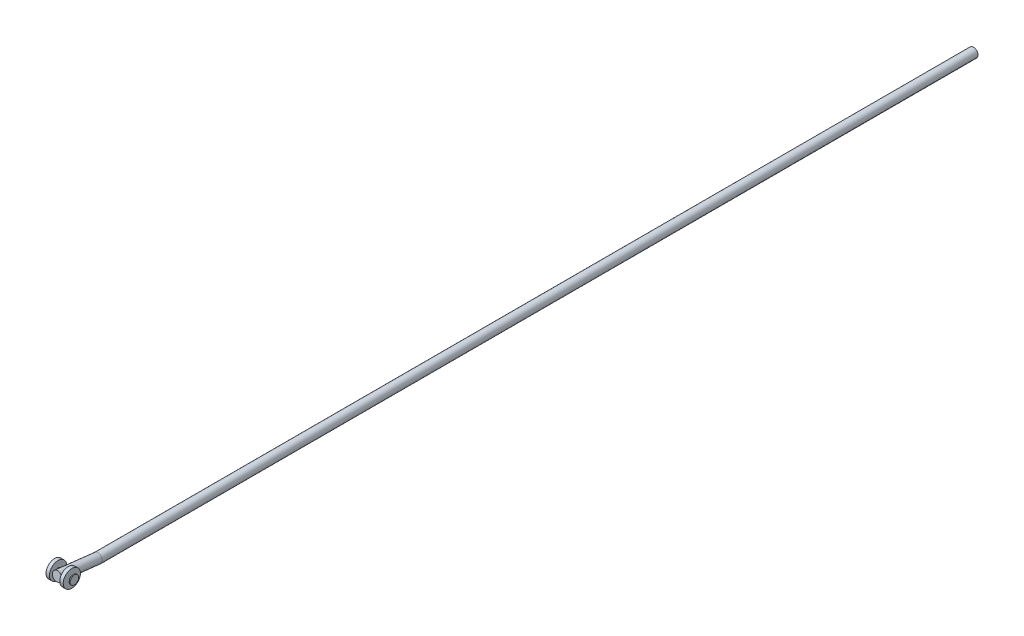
ISO-10303-21;
HEADER;
FILE_DESCRIPTION(('STEP AP214'),'2;1');
FILE_NAME('part.step','',(''),(''),'','','');
FILE_SCHEMA(('AUTOMOTIVE_DESIGN { 1 0 10303 214 1 1 1 1 }'));
ENDSEC;
DATA;
#1=APPLICATION_CONTEXT('core data for automotive mechanical design processes');
#2=APPLICATION_PROTOCOL_DEFINITION('international standard','automotive_design',2000,#1);
#3=PRODUCT_CONTEXT('',#1,'mechanical');
#4=PRODUCT('Part','Part','',(#3));
#5=PRODUCT_RELATED_PRODUCT_CATEGORY('part','',(#4));
#6=PRODUCT_DEFINITION_FORMATION('','',#4);
#7=PRODUCT_DEFINITION_CONTEXT('part definition',#1,'design');
#8=PRODUCT_DEFINITION('design','',#6,#7);
#9=PRODUCT_DEFINITION_SHAPE('','',#8);
#10=(LENGTH_UNIT() NAMED_UNIT(*) SI_UNIT(.MILLI.,.METRE.));
#11=(NAMED_UNIT(*) PLANE_ANGLE_UNIT() SI_UNIT($,.RADIAN.));
#12=(NAMED_UNIT(*) SI_UNIT($,.STERADIAN.) SOLID_ANGLE_UNIT());
#13=UNCERTAINTY_MEASURE_WITH_UNIT(LENGTH_MEASURE(1.E-05),#10,'distance_accuracy_value','');
#14=(GEOMETRIC_REPRESENTATION_CONTEXT(3) GLOBAL_UNCERTAINTY_ASSIGNED_CONTEXT((#13)) GLOBAL_UNIT_ASSIGNED_CONTEXT((#10,
#11,#12)) REPRESENTATION_CONTEXT('',''));
#15=CARTESIAN_POINT('',(0.,0.,0.));
#16=DIRECTION('',(0.,0.,1.));
#17=DIRECTION('',(1.,0.,0.));
#18=AXIS2_PLACEMENT_3D('',#15,#16,#17);
#19=CARTESIAN_POINT('',(9.75,3.41806824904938,792.5));
#20=DIRECTION('',(-1.,0.,0.));
#21=DIRECTION('',(0.,0.,1.));
#22=AXIS2_PLACEMENT_3D('',#19,#20,#21);
#23=CYLINDRICAL_SURFACE('',#22,2.);
#24=CARTESIAN_POINT('',(7.5,3.41806824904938,792.5));
#25=DIRECTION('',(-1.,0.,0.));
#26=DIRECTION('',(0.,0.,1.));
#27=AXIS2_PLACEMENT_3D('',#24,#25,#26);
#28=CIRCLE('',#27,2.);
#29=CARTESIAN_POINT('',(7.5,3.41806824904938,794.5));
#30=VERTEX_POINT('',#29);
#31=EDGE_CURVE('E20',#30,#30,#28,.T.);
#32=ORIENTED_EDGE('',*,*,#31,.F.);
#33=EDGE_LOOP('',(#32));
#34=FACE_BOUND('',#33,.T.);
#35=CARTESIAN_POINT('',(8.95,3.41806824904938,792.5));
#36=DIRECTION('',(1.,0.,0.));
#37=DIRECTION('',(0.,0.,-1.));
#38=AXIS2_PLACEMENT_3D('',#35,#36,#37);
#39=CIRCLE('',#38,2.);
#40=CARTESIAN_POINT('',(8.95,3.41806824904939,790.5));
#41=VERTEX_POINT('',#40);
#42=EDGE_CURVE('E8',#41,#41,#39,.T.);
#43=ORIENTED_EDGE('',*,*,#42,.F.);
#44=EDGE_LOOP('',(#43));
#45=FACE_BOUND('',#44,.T.);
#46=ADVANCED_FACE('F12',(#34,#45),#23,.T.);
#47=CARTESIAN_POINT('',(0.,0.,762.5));
#48=DIRECTION('',(0.,0.113203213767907,0.993571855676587));
#49=DIRECTION('',(0.,-0.993571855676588,0.113203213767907));
#50=AXIS2_PLACEMENT_3D('',#47,#48,#49);
#51=CYLINDRICAL_SURFACE('',#50,4.);
#52=CARTESIAN_POINT('',(-3.99358737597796,3.41806824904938,794.5));
#53=CARTESIAN_POINT('',(-3.99937040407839,3.52083185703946,794.499993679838));
#54=CARTESIAN_POINT('',(-4.00126596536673,3.6239184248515,794.492037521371));
#55=CARTESIAN_POINT('',(-3.99705373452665,3.82755391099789,794.460349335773));
#56=CARTESIAN_POINT('',(-3.99093520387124,3.92809924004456,794.436596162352));
#57=CARTESIAN_POINT('',(-3.97132265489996,4.12343046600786,794.374285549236));
#58=CARTESIAN_POINT('',(-3.95784720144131,4.21823019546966,794.335765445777));
#59=CARTESIAN_POINT('',(-3.92479936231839,4.39999315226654,794.245319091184));
#60=CARTESIAN_POINT('',(-3.9052268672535,4.48695623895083,794.1933925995));
#61=CARTESIAN_POINT('',(-3.860794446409,4.65468987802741,794.075344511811));
#62=CARTESIAN_POINT('',(-3.83575190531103,4.73506492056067,794.008731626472));
#63=CARTESIAN_POINT('',(-3.78309154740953,4.88412669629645,793.864351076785));
#64=CARTESIAN_POINT('',(-3.75547224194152,4.95280660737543,793.786576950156));
#65=CARTESIAN_POINT('',(-3.69731707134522,5.08348571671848,793.613236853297));
#66=CARTESIAN_POINT('',(-3.66676215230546,5.14415845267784,793.5166727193));
#67=CARTESIAN_POINT('',(-3.60884209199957,5.24855643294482,793.313832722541));
#68=CARTESIAN_POINT('',(-3.58147772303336,5.29227757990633,793.207554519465));
#69=CARTESIAN_POINT('',(-3.53343540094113,5.36124869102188,792.987240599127));
#70=CARTESIAN_POINT('',(-3.51277948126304,5.38643812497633,792.873180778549));
#71=CARTESIAN_POINT('',(-3.48162431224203,5.41649811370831,792.641114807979));
#72=CARTESIAN_POINT('',(-3.47110985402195,5.42139913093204,792.523114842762));
#73=CARTESIAN_POINT('',(-3.46268321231,5.4109421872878,792.302097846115));
#74=CARTESIAN_POINT('',(-3.46338626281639,5.39799006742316,792.199014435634));
#75=CARTESIAN_POINT('',(-3.47394233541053,5.35642104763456,791.996545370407));
#76=CARTESIAN_POINT('',(-3.48379609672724,5.327802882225,791.897160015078));
#77=CARTESIAN_POINT('',(-3.51058114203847,5.25784202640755,791.709567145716));
#78=CARTESIAN_POINT('',(-3.52715111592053,5.21717390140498,791.621052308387));
#79=CARTESIAN_POINT('',(-3.56542142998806,5.12405317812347,791.451685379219));
#80=CARTESIAN_POINT('',(-3.58712341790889,5.07159679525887,791.370835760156));
#81=CARTESIAN_POINT('',(-3.63604919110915,4.95001498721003,791.209897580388));
#82=CARTESIAN_POINT('',(-3.66361477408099,4.87971004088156,791.130804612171));
#83=CARTESIAN_POINT('',(-3.71971318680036,4.72772581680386,790.984771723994));
#84=CARTESIAN_POINT('',(-3.74824663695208,4.64603913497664,790.91783978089));
#85=CARTESIAN_POINT('',(-3.80636968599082,4.46428600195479,790.7915417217));
#86=CARTESIAN_POINT('',(-3.83579137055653,4.36320425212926,790.733547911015));
#87=CARTESIAN_POINT('',(-3.88944229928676,4.15134454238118,790.635621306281));
#88=CARTESIAN_POINT('',(-3.91367316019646,4.04056961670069,790.595682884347));
#89=CARTESIAN_POINT('',(-3.9533537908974,3.81687969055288,790.53689640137));
#90=CARTESIAN_POINT('',(-3.96911584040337,3.70422722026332,790.517269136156));
#91=CARTESIAN_POINT('',(-3.99144832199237,3.47635133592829,790.497588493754));
#92=CARTESIAN_POINT('',(-3.99802618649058,3.36113007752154,790.497519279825));
#93=CARTESIAN_POINT('',(-4.00105151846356,3.143597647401,790.516217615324));
#94=CARTESIAN_POINT('',(-3.99843484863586,3.04113478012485,790.533126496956));
#95=CARTESIAN_POINT('',(-3.98538179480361,2.84053554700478,790.582418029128));
#96=CARTESIAN_POINT('',(-3.97494569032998,2.74239902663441,790.614800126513));
#97=CARTESIAN_POINT('',(-3.94751258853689,2.55473751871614,790.69311619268));
#98=CARTESIAN_POINT('',(-3.93063121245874,2.46509368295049,790.738808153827));
#99=CARTESIAN_POINT('',(-3.89178602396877,2.29444036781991,790.842460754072));
#100=CARTESIAN_POINT('',(-3.86982092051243,2.21343308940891,790.900424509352));
#101=CARTESIAN_POINT('',(-3.82068014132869,2.05528166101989,791.032262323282));
#102=CARTESIAN_POINT('',(-3.79322649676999,1.97898217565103,791.10704491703));
#103=CARTESIAN_POINT('',(-3.73695766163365,1.83937451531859,791.267501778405));
#104=CARTESIAN_POINT('',(-3.70814145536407,1.7760762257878,791.353184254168));
#105=CARTESIAN_POINT('',(-3.64943029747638,1.65883711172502,791.541640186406));
#106=CARTESIAN_POINT('',(-3.61965595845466,1.6061705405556,791.645249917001));
#107=CARTESIAN_POINT('',(-3.56540497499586,1.5192458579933,791.861245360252));
#108=CARTESIAN_POINT('',(-3.54092619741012,1.48498032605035,791.973627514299));
#109=CARTESIAN_POINT('',(-3.50169898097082,1.4374997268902,792.199743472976));
#110=CARTESIAN_POINT('',(-3.48660715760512,1.42351314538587,792.313252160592));
#111=CARTESIAN_POINT('',(-3.4672253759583,1.41524850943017,792.541853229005));
#112=CARTESIAN_POINT('',(-3.4629222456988,1.42094640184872,792.656943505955));
#113=CARTESIAN_POINT('',(-3.46566946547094,1.45002321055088,792.869982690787));
#114=CARTESIAN_POINT('',(-3.47136600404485,1.47109950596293,792.968273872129));
#115=CARTESIAN_POINT('',(-3.49076284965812,1.5274234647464,793.159876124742));
#116=CARTESIAN_POINT('',(-3.50446544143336,1.56267517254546,793.253185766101));
#117=CARTESIAN_POINT('',(-3.53814243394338,1.64601909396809,793.432537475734));
#118=CARTESIAN_POINT('',(-3.55811370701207,1.69410490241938,793.518583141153));
#119=CARTESIAN_POINT('',(-3.60218691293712,1.80174486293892,793.681981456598));
#120=CARTESIAN_POINT('',(-3.62629024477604,1.86130289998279,793.759331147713));
#121=CARTESIAN_POINT('',(-3.67953416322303,1.99864251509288,793.913201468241));
#122=CARTESIAN_POINT('',(-3.70892913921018,2.07776661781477,793.988438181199));
#123=CARTESIAN_POINT('',(-3.76720952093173,2.24736352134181,794.125216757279));
#124=CARTESIAN_POINT('',(-3.79609442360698,2.33784688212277,794.186745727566));
#125=CARTESIAN_POINT('',(-3.85236688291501,2.5347314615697,794.298149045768));
#126=CARTESIAN_POINT('',(-3.87952938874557,2.64178941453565,794.346984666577));
#127=CARTESIAN_POINT('',(-3.92698634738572,2.86402905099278,794.425316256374));
#128=CARTESIAN_POINT('',(-3.94729855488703,2.97918878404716,794.454862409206));
#129=CARTESIAN_POINT('',(-3.97005554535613,3.14945629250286,794.482608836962));
#130=CARTESIAN_POINT('',(-3.97618789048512,3.20283030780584,794.489112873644));
#131=CARTESIAN_POINT('',(-3.98643408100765,3.31012918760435,794.497810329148));
#132=CARTESIAN_POINT('',(-3.99054772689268,3.36405410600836,794.500003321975));
#133=CARTESIAN_POINT('',(-3.99358737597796,3.41806824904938,794.5));
#134=B_SPLINE_CURVE_WITH_KNOTS('',3,(#52,#53,#54,#55,#56,#57,#58,#59,#60,#61,#62,#63,#64,#65,
#66,#67,#68,#69,#70,#71,#72,#73,#74,#75,#76,#77,#78,#79,#80,#81,#82,#83,#84,#85,#86,#87,#88,#89,
#90,#91,#92,#93,#94,#95,#96,#97,#98,#99,#100,#101,#102,#103,#104,#105,#106,#107,#108,#109,#110,
#111,#112,#113,#114,#115,#116,#117,#118,#119,#120,#121,#122,#123,#124,#125,#126,#127,#128,#129,
#130,#131,#132,#133),.UNSPECIFIED.,.T.,.F.,(4,2,2,2,2,2,2,2,2,2,2,2,2,2,2,2,2,2,2,2,2,2,2,2,2,2,
2,2,2,2,2,2,2,2,2,2,2,2,2,2,4),(0.,0.30856908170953,0.617552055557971,0.925758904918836,
1.23397128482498,1.55471444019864,1.87564405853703,2.22821798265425,2.58087707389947,
2.93468300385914,3.28795751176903,3.59799922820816,3.90806599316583,4.20329261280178,
4.49861414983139,4.82534672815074,5.15229285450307,5.5110903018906,5.86977583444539,
6.21412414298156,6.55819362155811,6.8683006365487,7.17839656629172,7.48317289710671,
7.78802671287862,8.11757839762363,8.44737973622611,8.8055660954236,9.16360790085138,
9.5076341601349,9.85124019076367,10.1518331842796,10.4525120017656,10.7530410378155,
11.0536720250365,11.3914576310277,11.7295596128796,12.0900019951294,12.4495028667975,
12.6116755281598,12.7738642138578),.UNSPECIFIED.);
#135=CARTESIAN_POINT('',(-3.99358737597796,3.41806824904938,794.5));
#136=VERTEX_POINT('',#135);
#137=EDGE_CURVE('E47',#136,#136,#134,.T.);
#138=ORIENTED_EDGE('',*,*,#137,.F.);
#139=EDGE_LOOP('',(#138));
#140=FACE_BOUND('',#139,.T.);
#141=CARTESIAN_POINT('',(0.,0.,762.5));
#142=DIRECTION('',(0.,0.0566927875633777,0.998391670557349));
#143=DIRECTION('',(0.,0.998391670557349,-0.0566927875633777));
#144=AXIS2_PLACEMENT_3D('',#141,#142,#143);
#145=ELLIPSE('',#144,4.00644368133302,4.);
#146=CARTESIAN_POINT('',(0.,4.,762.27286353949));
#147=VERTEX_POINT('',#146);
#148=EDGE_CURVE('E115',#147,#147,#145,.F.);
#149=ORIENTED_EDGE('',*,*,#148,.F.);
#150=EDGE_LOOP('',(#149));
#151=FACE_BOUND('',#150,.T.);
#152=CARTESIAN_POINT('',(0.,4.03218117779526,797.89));
#153=DIRECTION('',(0.,0.113203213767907,0.993571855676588));
#154=DIRECTION('',(0.,-0.993571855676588,0.113203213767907));
#155=AXIS2_PLACEMENT_3D('',#152,#153,#154);
#156=CIRCLE('',#155,4.);
#157=CARTESIAN_POINT('',(0.,0.0578937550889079,798.342812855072));
#158=VERTEX_POINT('',#157);
#159=EDGE_CURVE('E113',#158,#158,#156,.T.);
#160=ORIENTED_EDGE('',*,*,#159,.F.);
#161=EDGE_LOOP('',(#160));
#162=FACE_BOUND('',#161,.T.);
#163=CARTESIAN_POINT('',(3.99358737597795,3.41806824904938,794.5));
#164=CARTESIAN_POINT('',(3.98749308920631,3.30997215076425,794.49999370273));
#165=CARTESIAN_POINT('',(3.97707821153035,3.20197487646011,794.491184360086));
#166=CARTESIAN_POINT('',(3.94869154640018,2.98963618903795,794.456547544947));
#167=CARTESIAN_POINT('',(3.93070160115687,2.88530421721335,794.430679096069));
#168=CARTESIAN_POINT('',(3.88906878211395,2.68362880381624,794.363289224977));
#169=CARTESIAN_POINT('',(3.86545309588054,2.58625459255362,794.321842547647));
#170=CARTESIAN_POINT('',(3.8146964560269,2.39998180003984,794.224686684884));
#171=CARTESIAN_POINT('',(3.78755593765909,2.31108217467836,794.168979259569));
#172=CARTESIAN_POINT('',(3.73015274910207,2.13728452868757,794.040165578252));
#173=CARTESIAN_POINT('',(3.69980537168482,2.05312215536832,793.966102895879));
#174=CARTESIAN_POINT('',(3.6409472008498,1.89796551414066,793.80454563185));
#175=CARTESIAN_POINT('',(3.6124374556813,1.82697871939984,793.717043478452));
#176=CARTESIAN_POINT('',(3.55981419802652,1.69809426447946,793.527253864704));
#177=CARTESIAN_POINT('',(3.53586896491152,1.64068362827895,793.424585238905));
#178=CARTESIAN_POINT('',(3.49722192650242,1.5443865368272,793.209340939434));
#179=CARTESIAN_POINT('',(3.48250686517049,1.50547353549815,793.096779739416));
#180=CARTESIAN_POINT('',(3.46590658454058,1.45132692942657,792.878372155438));
#181=CARTESIAN_POINT('',(3.46278904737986,1.43396087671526,792.773147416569));
#182=CARTESIAN_POINT('',(3.466432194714,1.41619514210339,792.561456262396));
#183=CARTESIAN_POINT('',(3.47319098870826,1.41579221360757,792.454990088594));
#184=CARTESIAN_POINT('',(3.49465644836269,1.43104833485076,792.25246760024));
#185=CARTESIAN_POINT('',(3.50870991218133,1.4454709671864,792.156241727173));
#186=CARTESIAN_POINT('',(3.54264133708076,1.4877407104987,791.967871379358));
#187=CARTESIAN_POINT('',(3.56252112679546,1.51559203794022,791.875728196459));
#188=CARTESIAN_POINT('',(3.60796995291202,1.5867170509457,791.689489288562));
#189=CARTESIAN_POINT('',(3.63388111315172,1.631110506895,791.595906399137));
#190=CARTESIAN_POINT('',(3.6875889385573,1.73347599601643,791.417050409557));
#191=CARTESIAN_POINT('',(3.71538677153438,1.79145649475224,791.331782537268));
#192=CARTESIAN_POINT('',(3.77350073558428,1.92726056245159,791.161859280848));
#193=CARTESIAN_POINT('',(3.8037440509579,2.00659035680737,791.07837471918));
#194=CARTESIAN_POINT('',(3.86025903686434,2.17922180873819,790.925664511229));
#195=CARTESIAN_POINT('',(3.88653082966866,2.27252303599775,790.856438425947));
#196=CARTESIAN_POINT('',(3.93189876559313,2.46960031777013,790.735466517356));
#197=CARTESIAN_POINT('',(3.95109048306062,2.57321089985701,790.683488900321));
#198=CARTESIAN_POINT('',(3.98055431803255,2.78894553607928,790.597992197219));
#199=CARTESIAN_POINT('',(3.99083441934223,2.90106187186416,790.564456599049));
#200=CARTESIAN_POINT('',(4.00069753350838,3.11837964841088,790.519787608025));
#201=CARTESIAN_POINT('',(4.00124897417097,3.22314868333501,790.506746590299));
#202=CARTESIAN_POINT('',(3.99406901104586,3.43313775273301,790.497298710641));
#203=CARTESIAN_POINT('',(3.98633880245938,3.5383577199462,790.500889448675));
#204=CARTESIAN_POINT('',(3.9638353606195,3.74210885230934,790.523863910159));
#205=CARTESIAN_POINT('',(3.94934283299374,3.84074192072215,790.542638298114));
#206=CARTESIAN_POINT('',(3.91473719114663,4.03317390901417,790.594329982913));
#207=CARTESIAN_POINT('',(3.89462293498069,4.12697184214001,790.627250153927));
#208=CARTESIAN_POINT('',(3.84894231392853,4.3139960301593,790.708795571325));
#209=CARTESIAN_POINT('',(3.82309969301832,4.40675688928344,790.758330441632));
#210=CARTESIAN_POINT('',(3.76918536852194,4.58299415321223,790.870921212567));
#211=CARTESIAN_POINT('',(3.74111218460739,4.6664643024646,790.933986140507));
#212=CARTESIAN_POINT('',(3.68256139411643,4.83009751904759,791.079002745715));
#213=CARTESIAN_POINT('',(3.6521095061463,4.909188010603,791.162181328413));
#214=CARTESIAN_POINT('',(3.59502919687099,5.05253348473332,791.341677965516));
#215=CARTESIAN_POINT('',(3.56840096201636,5.11678774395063,791.43799666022));
#216=CARTESIAN_POINT('',(3.52281400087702,5.22774267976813,791.640760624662));
#217=CARTESIAN_POINT('',(3.50378417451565,5.27460578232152,791.747099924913));
#218=CARTESIAN_POINT('',(3.47616820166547,5.34936257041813,791.967470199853));
#219=CARTESIAN_POINT('',(3.4675669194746,5.37728372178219,792.081489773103));
#220=CARTESIAN_POINT('',(3.4626778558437,5.41051584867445,792.298374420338));
#221=CARTESIAN_POINT('',(3.46498303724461,5.4182202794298,792.400848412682));
#222=CARTESIAN_POINT('',(3.47839582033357,5.41791165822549,792.605191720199));
#223=CARTESIAN_POINT('',(3.48950487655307,5.40989600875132,792.707060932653));
#224=CARTESIAN_POINT('',(3.51849768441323,5.3793022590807,792.903932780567));
#225=CARTESIAN_POINT('',(3.53614055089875,5.35722393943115,792.999051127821));
#226=CARTESIAN_POINT('',(3.57625173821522,5.29991232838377,793.184148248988));
#227=CARTESIAN_POINT('',(3.59872170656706,5.264674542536,793.274125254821));
#228=CARTESIAN_POINT('',(3.64907495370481,5.17731075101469,793.457340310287));
#229=CARTESIAN_POINT('',(3.67728312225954,5.12372348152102,793.549792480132));
#230=CARTESIAN_POINT('',(3.73422806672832,5.0026325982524,793.724950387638));
#231=CARTESIAN_POINT('',(3.76296514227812,4.93512086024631,793.807650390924));
#232=CARTESIAN_POINT('',(3.82075045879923,4.78081390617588,793.968470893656));
#233=CARTESIAN_POINT('',(3.84960203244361,4.69284221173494,794.045541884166));
#234=CARTESIAN_POINT('',(3.90160341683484,4.50364034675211,794.183818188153));
#235=CARTESIAN_POINT('',(3.92475344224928,4.40241067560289,794.245024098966));
#236=CARTESIAN_POINT('',(3.96169304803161,4.1947429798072,794.346473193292));
#237=CARTESIAN_POINT('',(3.97589092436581,4.08881442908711,794.387607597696));
#238=CARTESIAN_POINT('',(3.99500612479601,3.87088974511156,794.451350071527));
#239=CARTESIAN_POINT('',(3.99994832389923,3.75891070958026,794.474007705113));
#240=CARTESIAN_POINT('',(4.00001693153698,3.60814677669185,794.491314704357));
#241=CARTESIAN_POINT('',(3.99948422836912,3.57018324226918,794.494570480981));
#242=CARTESIAN_POINT('',(3.99734178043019,3.49416513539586,794.498914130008));
#243=CARTESIAN_POINT('',(3.99573214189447,3.45611057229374,794.500002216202));
#244=CARTESIAN_POINT('',(3.99358737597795,3.41806824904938,794.5));
#245=B_SPLINE_CURVE_WITH_KNOTS('',3,(#163,#164,#165,#166,#167,#168,#169,#170,#171,#172,#173,
#174,#175,#176,#177,#178,#179,#180,#181,#182,#183,#184,#185,#186,#187,#188,#189,#190,#191,#192,
#193,#194,#195,#196,#197,#198,#199,#200,#201,#202,#203,#204,#205,#206,#207,#208,#209,#210,#211,
#212,#213,#214,#215,#216,#217,#218,#219,#220,#221,#222,#223,#224,#225,#226,#227,#228,#229,#230,
#231,#232,#233,#234,#235,#236,#237,#238,#239,#240,#241,#242,#243,#244),.UNSPECIFIED.,.T.,.F.,(4,
2,2,2,2,2,2,2,2,2,2,2,2,2,2,2,2,2,2,2,2,2,2,2,2,2,2,2,2,2,2,2,2,2,2,2,2,2,2,2,4),(0.,
0.324645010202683,0.650072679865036,0.973958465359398,1.29780429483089,1.6447091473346,
1.99181016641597,2.34992937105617,2.70753307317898,3.0258343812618,3.34407476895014,
3.63777018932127,3.93155788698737,4.25059574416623,4.56983291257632,4.92534924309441,
5.28085462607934,5.6313683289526,5.98156768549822,6.29668549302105,6.61175782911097,
6.91477864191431,7.21786105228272,7.54138871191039,7.86513290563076,8.21971858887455,
8.57432155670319,8.92552395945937,9.27621602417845,9.58299411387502,9.88982289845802,
10.1863131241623,10.4829047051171,10.8131058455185,11.1435001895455,11.5030741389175,
11.8626345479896,12.2043113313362,12.5450685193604,12.6593322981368,12.7735848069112),.UNSPECIFIED.);
#246=CARTESIAN_POINT('',(3.99358737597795,3.41806824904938,794.5));
#247=VERTEX_POINT('',#246);
#248=EDGE_CURVE('E28',#247,#247,#245,.T.);
#249=ORIENTED_EDGE('',*,*,#248,.F.);
#250=EDGE_LOOP('',(#249));
#251=FACE_BOUND('',#250,.T.);
#252=ADVANCED_FACE('F14',(#140,#151,#162,#251),#51,.T.);
#253=CARTESIAN_POINT('',(0.,0.,0.));
#254=DIRECTION('',(0.,0.,-1.));
#255=DIRECTION('',(-1.,0.,0.));
#256=AXIS2_PLACEMENT_3D('',#253,#254,#255);
#257=PLANE('',#256);
#258=CARTESIAN_POINT('',(0.,0.,0.));
#259=DIRECTION('',(0.,0.,-1.));
#260=DIRECTION('',(-1.,0.,0.));
#261=AXIS2_PLACEMENT_3D('',#258,#259,#260);
#262=CIRCLE('',#261,4.);
#263=CARTESIAN_POINT('',(-4.,0.,0.));
#264=VERTEX_POINT('',#263);
#265=EDGE_CURVE('E118',#264,#264,#262,.T.);
#266=ORIENTED_EDGE('',*,*,#265,.T.);
#267=EDGE_LOOP('',(#266));
#268=FACE_BOUND('',#267,.T.);
#269=ADVANCED_FACE('F68',(#268),#257,.T.);
#270=CARTESIAN_POINT('',(0.,0.,773.813708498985));
#271=DIRECTION('',(0.,0.,-1.));
#272=DIRECTION('',(0.,1.,0.));
#273=AXIS2_PLACEMENT_3D('',#270,#271,#272);
#274=CYLINDRICAL_SURFACE('',#273,4.);
#275=ORIENTED_EDGE('',*,*,#265,.F.);
#276=EDGE_LOOP('',(#275));
#277=FACE_BOUND('',#276,.T.);
#278=ORIENTED_EDGE('',*,*,#148,.T.);
#279=EDGE_LOOP('',(#278));
#280=FACE_BOUND('',#279,.T.);
#281=ADVANCED_FACE('F66',(#277,#280),#274,.T.);
#282=CARTESIAN_POINT('',(0.,4.03218117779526,797.89));
#283=DIRECTION('',(0.,0.113203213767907,0.993571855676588));
#284=DIRECTION('',(0.,-0.993571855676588,0.113203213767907));
#285=AXIS2_PLACEMENT_3D('',#282,#283,#284);
#286=PLANE('',#285);
#287=ORIENTED_EDGE('',*,*,#159,.T.);
#288=EDGE_LOOP('',(#287));
#289=FACE_BOUND('',#288,.T.);
#290=ADVANCED_FACE('F62',(#289),#286,.T.);
#291=CARTESIAN_POINT('',(-4.5,3.41806824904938,792.5));
#292=DIRECTION('',(1.,0.,0.));
#293=DIRECTION('',(0.,0.,-1.));
#294=AXIS2_PLACEMENT_3D('',#291,#292,#293);
#295=CIRCLE('',#294,2.);
#296=CARTESIAN_POINT('',(-4.5,3.41806824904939,790.5));
#297=VERTEX_POINT('',#296);
#298=EDGE_CURVE('E36',#297,#297,#295,.T.);
#299=ORIENTED_EDGE('',*,*,#298,.T.);
#300=EDGE_LOOP('',(#299));
#301=FACE_BOUND('',#300,.T.);
#302=ORIENTED_EDGE('',*,*,#137,.T.);
#303=EDGE_LOOP('',(#302));
#304=FACE_BOUND('',#303,.T.);
#305=ADVANCED_FACE('F58',(#301,#304),#23,.T.);
#306=CARTESIAN_POINT('',(4.5,3.41806824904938,792.5));
#307=DIRECTION('',(-1.,0.,0.));
#308=DIRECTION('',(0.,0.,1.));
#309=AXIS2_PLACEMENT_3D('',#306,#307,#308);
#310=CIRCLE('',#309,2.);
#311=CARTESIAN_POINT('',(4.5,3.41806824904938,794.5));
#312=VERTEX_POINT('',#311);
#313=EDGE_CURVE('E31',#312,#312,#310,.T.);
#314=ORIENTED_EDGE('',*,*,#313,.T.);
#315=EDGE_LOOP('',(#314));
#316=FACE_BOUND('',#315,.T.);
#317=ORIENTED_EDGE('',*,*,#248,.T.);
#318=EDGE_LOOP('',(#317));
#319=FACE_BOUND('',#318,.T.);
#320=ADVANCED_FACE('F52',(#316,#319),#23,.T.);
#321=CARTESIAN_POINT('',(-7.5,3.41806824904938,792.5));
#322=DIRECTION('',(1.,0.,0.));
#323=DIRECTION('',(0.,0.,-1.));
#324=AXIS2_PLACEMENT_3D('',#321,#322,#323);
#325=PLANE('',#324);
#326=CARTESIAN_POINT('',(-7.5,3.41806824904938,792.5));
#327=DIRECTION('',(1.,0.,0.));
#328=DIRECTION('',(0.,0.,-1.));
#329=AXIS2_PLACEMENT_3D('',#326,#327,#328);
#330=CIRCLE('',#329,7.5);
#331=CARTESIAN_POINT('',(-7.5,3.41806824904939,785.));
#332=VERTEX_POINT('',#331);
#333=EDGE_CURVE('E40',#332,#332,#330,.T.);
#334=ORIENTED_EDGE('',*,*,#333,.F.);
#335=EDGE_LOOP('',(#334));
#336=FACE_BOUND('',#335,.T.);
#337=CARTESIAN_POINT('',(-7.5,3.41806824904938,792.5));
#338=DIRECTION('',(1.,0.,0.));
#339=DIRECTION('',(0.,0.,-1.));
#340=AXIS2_PLACEMENT_3D('',#337,#338,#339);
#341=CIRCLE('',#340,2.);
#342=CARTESIAN_POINT('',(-7.5,3.41806824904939,790.5));
#343=VERTEX_POINT('',#342);
#344=EDGE_CURVE('E24',#343,#343,#341,.T.);
#345=ORIENTED_EDGE('',*,*,#344,.T.);
#346=EDGE_LOOP('',(#345));
#347=FACE_BOUND('',#346,.T.);
#348=ADVANCED_FACE('F57',(#336,#347),#325,.F.);
#349=CARTESIAN_POINT('',(-4.5,3.41806824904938,792.5));
#350=DIRECTION('',(1.,0.,0.));
#351=DIRECTION('',(0.,0.,-1.));
#352=AXIS2_PLACEMENT_3D('',#349,#350,#351);
#353=PLANE('',#352);
#354=CARTESIAN_POINT('',(-4.5,3.41806824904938,792.5));
#355=DIRECTION('',(1.,0.,0.));
#356=DIRECTION('',(0.,0.,-1.));
#357=AXIS2_PLACEMENT_3D('',#354,#355,#356);
#358=CIRCLE('',#357,7.5);
#359=CARTESIAN_POINT('',(-4.5,3.41806824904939,785.));
#360=VERTEX_POINT('',#359);
#361=EDGE_CURVE('E33',#360,#360,#358,.T.);
#362=ORIENTED_EDGE('',*,*,#361,.T.);
#363=EDGE_LOOP('',(#362));
#364=FACE_BOUND('',#363,.T.);
#365=ORIENTED_EDGE('',*,*,#298,.F.);
#366=EDGE_LOOP('',(#365));
#367=FACE_BOUND('',#366,.T.);
#368=ADVANCED_FACE('F161',(#364,#367),#353,.T.);
#369=CARTESIAN_POINT('',(-7.5,3.41806824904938,792.5));
#370=DIRECTION('',(1.,0.,0.));
#371=DIRECTION('',(0.,0.,-1.));
#372=AXIS2_PLACEMENT_3D('',#369,#370,#371);
#373=CYLINDRICAL_SURFACE('',#372,7.5);
#374=ORIENTED_EDGE('',*,*,#333,.T.);
#375=EDGE_LOOP('',(#374));
#376=FACE_BOUND('',#375,.T.);
#377=ORIENTED_EDGE('',*,*,#361,.F.);
#378=EDGE_LOOP('',(#377));
#379=FACE_BOUND('',#378,.T.);
#380=ADVANCED_FACE('F100',(#376,#379),#373,.T.);
#381=CARTESIAN_POINT('',(-9.75,3.41806824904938,792.5));
#382=DIRECTION('',(1.,0.,0.));
#383=DIRECTION('',(0.,0.,-1.));
#384=AXIS2_PLACEMENT_3D('',#381,#382,#383);
#385=PLANE('',#384);
#386=CARTESIAN_POINT('',(-9.75,3.41806824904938,792.5));
#387=DIRECTION('',(1.,0.,0.));
#388=DIRECTION('',(0.,0.,-1.));
#389=AXIS2_PLACEMENT_3D('',#386,#387,#388);
#390=CIRCLE('',#389,2.);
#391=CARTESIAN_POINT('',(-9.75,3.41806824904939,790.5));
#392=VERTEX_POINT('',#391);
#393=EDGE_CURVE('E39',#392,#392,#390,.T.);
#394=ORIENTED_EDGE('',*,*,#393,.F.);
#395=EDGE_LOOP('',(#394));
#396=FACE_BOUND('',#395,.T.);
#397=ADVANCED_FACE('F90',(#396),#385,.F.);
#398=ORIENTED_EDGE('',*,*,#393,.T.);
#399=EDGE_LOOP('',(#398));
#400=FACE_BOUND('',#399,.T.);
#401=ORIENTED_EDGE('',*,*,#344,.F.);
#402=EDGE_LOOP('',(#401));
#403=FACE_BOUND('',#402,.T.);
#404=ADVANCED_FACE('F81',(#400,#403),#23,.T.);
#405=CARTESIAN_POINT('',(7.5,3.41806824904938,792.5));
#406=DIRECTION('',(-1.,0.,0.));
#407=DIRECTION('',(0.,0.,-1.));
#408=AXIS2_PLACEMENT_3D('',#405,#406,#407);
#409=PLANE('',#408);
#410=CARTESIAN_POINT('',(7.5,3.41806824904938,792.5));
#411=DIRECTION('',(1.,0.,0.));
#412=DIRECTION('',(0.,0.,-1.));
#413=AXIS2_PLACEMENT_3D('',#410,#411,#412);
#414=CIRCLE('',#413,7.5);
#415=CARTESIAN_POINT('',(7.5,3.41806824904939,785.));
#416=VERTEX_POINT('',#415);
#417=EDGE_CURVE('E34',#416,#416,#414,.T.);
#418=ORIENTED_EDGE('',*,*,#417,.T.);
#419=EDGE_LOOP('',(#418));
#420=FACE_BOUND('',#419,.T.);
#421=ORIENTED_EDGE('',*,*,#31,.T.);
#422=EDGE_LOOP('',(#421));
#423=FACE_BOUND('',#422,.T.);
#424=ADVANCED_FACE('F89',(#420,#423),#409,.F.);
#425=CARTESIAN_POINT('',(4.5,3.41806824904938,792.5));
#426=DIRECTION('',(-1.,0.,0.));
#427=DIRECTION('',(0.,0.,-1.));
#428=AXIS2_PLACEMENT_3D('',#425,#426,#427);
#429=PLANE('',#428);
#430=CARTESIAN_POINT('',(4.5,3.41806824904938,792.5));
#431=DIRECTION('',(1.,0.,0.));
#432=DIRECTION('',(0.,0.,-1.));
#433=AXIS2_PLACEMENT_3D('',#430,#431,#432);
#434=CIRCLE('',#433,7.5);
#435=CARTESIAN_POINT('',(4.5,3.41806824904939,785.));
#436=VERTEX_POINT('',#435);
#437=EDGE_CURVE('E130',#436,#436,#434,.T.);
#438=ORIENTED_EDGE('',*,*,#437,.F.);
#439=EDGE_LOOP('',(#438));
#440=FACE_BOUND('',#439,.T.);
#441=ORIENTED_EDGE('',*,*,#313,.F.);
#442=EDGE_LOOP('',(#441));
#443=FACE_BOUND('',#442,.T.);
#444=ADVANCED_FACE('F97',(#440,#443),#429,.T.);
#445=CARTESIAN_POINT('',(7.5,3.41806824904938,792.5));
#446=DIRECTION('',(-1.,0.,0.));
#447=DIRECTION('',(0.,0.,1.));
#448=AXIS2_PLACEMENT_3D('',#445,#446,#447);
#449=CYLINDRICAL_SURFACE('',#448,7.5);
#450=ORIENTED_EDGE('',*,*,#417,.F.);
#451=EDGE_LOOP('',(#450));
#452=FACE_BOUND('',#451,.T.);
#453=ORIENTED_EDGE('',*,*,#437,.T.);
#454=EDGE_LOOP('',(#453));
#455=FACE_BOUND('',#454,.T.);
#456=ADVANCED_FACE('F151',(#452,#455),#449,.T.);
#457=CARTESIAN_POINT('',(8.95,3.41806824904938,792.5));
#458=DIRECTION('',(1.,0.,0.));
#459=DIRECTION('',(0.,0.,-1.));
#460=AXIS2_PLACEMENT_3D('',#457,#458,#459);
#461=PLANE('',#460);
#462=CARTESIAN_POINT('',(8.95,3.41806824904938,792.5));
#463=DIRECTION('',(1.,0.,0.));
#464=DIRECTION('',(0.,0.,-1.));
#465=AXIS2_PLACEMENT_3D('',#462,#463,#464);
#466=CIRCLE('',#465,3.75);
#467=CARTESIAN_POINT('',(8.95,3.41806824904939,788.75));
#468=VERTEX_POINT('',#467);
#469=EDGE_CURVE('E133',#468,#468,#466,.T.);
#470=ORIENTED_EDGE('',*,*,#469,.F.);
#471=EDGE_LOOP('',(#470));
#472=FACE_BOUND('',#471,.T.);
#473=ORIENTED_EDGE('',*,*,#42,.T.);
#474=EDGE_LOOP('',(#473));
#475=FACE_BOUND('',#474,.T.);
#476=ADVANCED_FACE('F143',(#472,#475),#461,.F.);
#477=CARTESIAN_POINT('',(8.95,3.41806824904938,792.5));
#478=DIRECTION('',(1.,0.,0.));
#479=DIRECTION('',(0.,0.,-1.));
#480=AXIS2_PLACEMENT_3D('',#477,#478,#479);
#481=CYLINDRICAL_SURFACE('',#480,3.75);
#482=ORIENTED_EDGE('',*,*,#469,.T.);
#483=EDGE_LOOP('',(#482));
#484=FACE_BOUND('',#483,.T.);
#485=CARTESIAN_POINT('',(9.75,3.41806824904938,792.5));
#486=DIRECTION('',(1.,0.,0.));
#487=DIRECTION('',(0.,0.,-1.));
#488=AXIS2_PLACEMENT_3D('',#485,#486,#487);
#489=CIRCLE('',#488,3.75);
#490=CARTESIAN_POINT('',(9.75,3.41806824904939,788.75));
#491=VERTEX_POINT('',#490);
#492=EDGE_CURVE('E136',#491,#491,#489,.T.);
#493=ORIENTED_EDGE('',*,*,#492,.F.);
#494=EDGE_LOOP('',(#493));
#495=FACE_BOUND('',#494,.T.);
#496=ADVANCED_FACE('F141',(#484,#495),#481,.T.);
#497=CARTESIAN_POINT('',(9.75,3.41806824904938,792.5));
#498=DIRECTION('',(1.,0.,0.));
#499=DIRECTION('',(0.,0.,-1.));
#500=AXIS2_PLACEMENT_3D('',#497,#498,#499);
#501=PLANE('',#500);
#502=ORIENTED_EDGE('',*,*,#492,.T.);
#503=EDGE_LOOP('',(#502));
#504=FACE_BOUND('',#503,.T.);
#505=ADVANCED_FACE('F60',(#504),#501,.T.);
#506=CLOSED_SHELL('',(#46,#252,#269,#281,#290,#305,#320,#348,#368,#380,#397,#404,#424,#444,#456,
#476,#496,#505));
#507=MANIFOLD_SOLID_BREP('B1',#506);
#508=ADVANCED_BREP_SHAPE_REPRESENTATION('',(#18,#507),#14);
#509=SHAPE_DEFINITION_REPRESENTATION(#9,#508);
ENDSEC;
END-ISO-10303-21;
